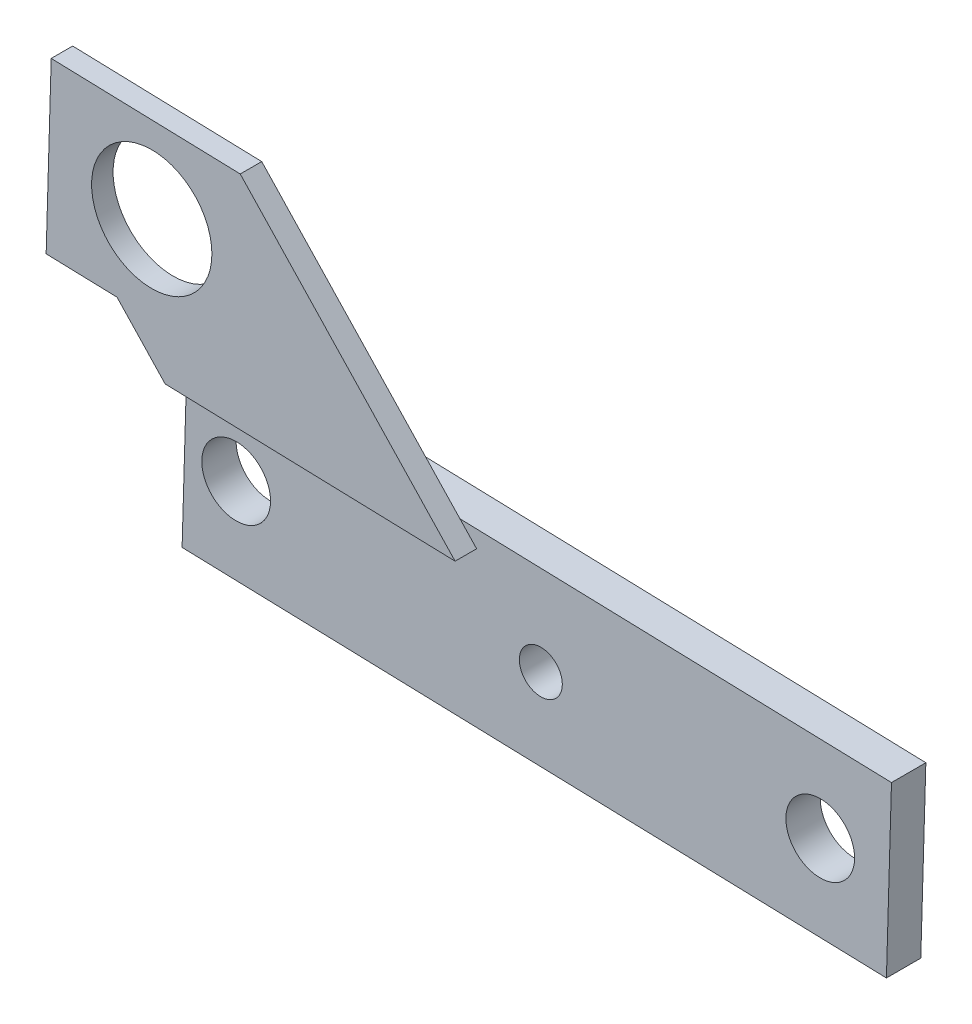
ISO-10303-21;
HEADER;
FILE_DESCRIPTION(('STEP AP214'),'2;1');
FILE_NAME('part.step','',(''),(''),'','','');
FILE_SCHEMA(('AUTOMOTIVE_DESIGN { 1 0 10303 214 1 1 1 1 }'));
ENDSEC;
DATA;
#1=APPLICATION_CONTEXT('core data for automotive mechanical design processes');
#2=APPLICATION_PROTOCOL_DEFINITION('international standard','automotive_design',2000,#1);
#3=PRODUCT_CONTEXT('',#1,'mechanical');
#4=PRODUCT('Part','Part','',(#3));
#5=PRODUCT_RELATED_PRODUCT_CATEGORY('part','',(#4));
#6=PRODUCT_DEFINITION_FORMATION('','',#4);
#7=PRODUCT_DEFINITION_CONTEXT('part definition',#1,'design');
#8=PRODUCT_DEFINITION('design','',#6,#7);
#9=PRODUCT_DEFINITION_SHAPE('','',#8);
#10=(LENGTH_UNIT() NAMED_UNIT(*) SI_UNIT(.MILLI.,.METRE.));
#11=(NAMED_UNIT(*) PLANE_ANGLE_UNIT() SI_UNIT($,.RADIAN.));
#12=(NAMED_UNIT(*) SI_UNIT($,.STERADIAN.) SOLID_ANGLE_UNIT());
#13=UNCERTAINTY_MEASURE_WITH_UNIT(LENGTH_MEASURE(1.E-05),#10,'distance_accuracy_value','');
#14=(GEOMETRIC_REPRESENTATION_CONTEXT(3) GLOBAL_UNCERTAINTY_ASSIGNED_CONTEXT((#13)) GLOBAL_UNIT_ASSIGNED_CONTEXT((#10,
#11,#12)) REPRESENTATION_CONTEXT('',''));
#15=CARTESIAN_POINT('',(0.,0.,0.));
#16=DIRECTION('',(0.,0.,1.));
#17=DIRECTION('',(1.,0.,0.));
#18=AXIS2_PLACEMENT_3D('',#15,#16,#17);
#19=CARTESIAN_POINT('',(41.4981401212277,-18.1154839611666,2.));
#20=DIRECTION('',(0.,0.,-1.));
#21=DIRECTION('',(-1.,0.,0.));
#22=AXIS2_PLACEMENT_3D('',#19,#20,#21);
#23=PLANE('',#22);
#24=CARTESIAN_POINT('',(3.66163848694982,-12.,2.));
#25=DIRECTION('',(0.,0.,1.));
#26=DIRECTION('',(1.,0.,0.));
#27=AXIS2_PLACEMENT_3D('',#24,#25,#26);
#28=CIRCLE('',#27,2.);
#29=CARTESIAN_POINT('',(5.66163848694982,-12.,2.));
#30=VERTEX_POINT('',#29);
#31=EDGE_CURVE('E188',#30,#30,#28,.T.);
#32=ORIENTED_EDGE('',*,*,#31,.F.);
#33=EDGE_LOOP('',(#32));
#34=FACE_BOUND('',#33,.T.);
#35=CARTESIAN_POINT('',(37.6469294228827,-13.,2.));
#36=DIRECTION('',(0.,0.,1.));
#37=DIRECTION('',(1.,0.,0.));
#38=AXIS2_PLACEMENT_3D('',#35,#36,#37);
#39=CIRCLE('',#38,2.);
#40=CARTESIAN_POINT('',(39.6469294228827,-13.,2.));
#41=VERTEX_POINT('',#40);
#42=EDGE_CURVE('E197',#41,#41,#39,.T.);
#43=ORIENTED_EDGE('',*,*,#42,.F.);
#44=EDGE_LOOP('',(#43));
#45=FACE_BOUND('',#44,.T.);
#46=CARTESIAN_POINT('',(21.3892111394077,-12.75,2.));
#47=DIRECTION('',(0.,0.,1.));
#48=DIRECTION('',(1.,0.,0.));
#49=AXIS2_PLACEMENT_3D('',#46,#47,#48);
#50=CIRCLE('',#49,1.25);
#51=CARTESIAN_POINT('',(22.6392111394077,-12.75,2.));
#52=VERTEX_POINT('',#51);
#53=EDGE_CURVE('E191',#52,#52,#50,.T.);
#54=ORIENTED_EDGE('',*,*,#53,.F.);
#55=EDGE_LOOP('',(#54));
#56=FACE_BOUND('',#55,.T.);
#57=DIRECTION('',(-0.686003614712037,0.727598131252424,0.));
#58=VECTOR('',#57,1.);
#59=CARTESIAN_POINT('',(5.14965454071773,4.85063805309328,2.));
#60=LINE('',#59,#58);
#61=CARTESIAN_POINT('',(17.6521598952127,-8.40993279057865,2.));
#62=VERTEX_POINT('',#61);
#63=CARTESIAN_POINT('',(16.68200427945,-7.38095364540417,2.));
#64=VERTEX_POINT('',#63);
#65=EDGE_CURVE('E150',#62,#64,#60,.T.);
#66=ORIENTED_EDGE('',*,*,#65,.F.);
#67=DIRECTION('',(0.999567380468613,-0.0294117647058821,0.));
#68=VECTOR('',#67,1.);
#69=CARTESIAN_POINT('',(0.780583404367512,-7.9134951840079,2.));
#70=LINE('',#69,#68);
#71=CARTESIAN_POINT('',(0.780583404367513,-7.9134951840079,2.));
#72=VERTEX_POINT('',#71);
#73=EDGE_CURVE('E47',#72,#62,#70,.T.);
#74=ORIENTED_EDGE('',*,*,#73,.F.);
#75=DIRECTION('',(-0.0294117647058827,-0.999567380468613,0.));
#76=VECTOR('',#75,1.);
#77=CARTESIAN_POINT('',(0.809995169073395,-6.91392780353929,2.));
#78=LINE('',#77,#76);
#79=CARTESIAN_POINT('',(0.515877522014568,-16.9096016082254,2.));
#80=VERTEX_POINT('',#79);
#81=EDGE_CURVE('E214',#72,#80,#78,.T.);
#82=ORIENTED_EDGE('',*,*,#81,.T.);
#83=DIRECTION('',(0.999567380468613,-0.0294117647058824,0.));
#84=VECTOR('',#83,1.);
#85=CARTESIAN_POINT('',(41.4981401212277,-18.1154839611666,2.));
#86=LINE('',#85,#84);
#87=CARTESIAN_POINT('',(41.4981401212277,-18.1154839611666,2.));
#88=VERTEX_POINT('',#87);
#89=EDGE_CURVE('E217',#80,#88,#86,.T.);
#90=ORIENTED_EDGE('',*,*,#89,.T.);
#91=DIRECTION('',(0.0294117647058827,0.999567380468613,0.));
#92=VECTOR('',#91,1.);
#93=CARTESIAN_POINT('',(41.7922577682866,-8.11981015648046,2.));
#94=LINE('',#93,#92);
#95=CARTESIAN_POINT('',(41.7922577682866,-8.11981015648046,2.));
#96=VERTEX_POINT('',#95);
#97=EDGE_CURVE('E209',#88,#96,#94,.T.);
#98=ORIENTED_EDGE('',*,*,#97,.T.);
#99=DIRECTION('',(-0.999567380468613,0.0294117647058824,0.));
#100=VECTOR('',#99,1.);
#101=CARTESIAN_POINT('',(41.7922577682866,-8.11981015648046,2.));
#102=LINE('',#101,#100);
#103=EDGE_CURVE('E212',#96,#64,#102,.T.);
#104=ORIENTED_EDGE('',*,*,#103,.T.);
#105=EDGE_LOOP('',(#66,#74,#82,#90,#98,#104));
#106=FACE_BOUND('',#105,.T.);
#107=ADVANCED_FACE('F32',(#34,#45,#56,#106),#23,.F.);
#108=CARTESIAN_POINT('',(41.4981401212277,-18.1154839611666,0.));
#109=DIRECTION('',(0.,0.,-1.));
#110=DIRECTION('',(-1.,0.,0.));
#111=AXIS2_PLACEMENT_3D('',#108,#109,#110);
#112=PLANE('',#111);
#113=CARTESIAN_POINT('',(3.66163848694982,-12.,0.));
#114=DIRECTION('',(0.,0.,1.));
#115=DIRECTION('',(1.,0.,0.));
#116=AXIS2_PLACEMENT_3D('',#113,#114,#115);
#117=CIRCLE('',#116,2.);
#118=CARTESIAN_POINT('',(5.66163848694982,-12.,0.));
#119=VERTEX_POINT('',#118);
#120=EDGE_CURVE('E183',#119,#119,#117,.T.);
#121=ORIENTED_EDGE('',*,*,#120,.T.);
#122=EDGE_LOOP('',(#121));
#123=FACE_BOUND('',#122,.T.);
#124=CARTESIAN_POINT('',(37.6469294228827,-13.,0.));
#125=DIRECTION('',(0.,0.,1.));
#126=DIRECTION('',(1.,0.,0.));
#127=AXIS2_PLACEMENT_3D('',#124,#125,#126);
#128=CIRCLE('',#127,2.);
#129=CARTESIAN_POINT('',(39.6469294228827,-13.,0.));
#130=VERTEX_POINT('',#129);
#131=EDGE_CURVE('E194',#130,#130,#128,.T.);
#132=ORIENTED_EDGE('',*,*,#131,.T.);
#133=EDGE_LOOP('',(#132));
#134=FACE_BOUND('',#133,.T.);
#135=DIRECTION('',(0.0294117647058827,0.999567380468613,0.));
#136=VECTOR('',#135,1.);
#137=CARTESIAN_POINT('',(41.7922577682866,-8.11981015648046,0.));
#138=LINE('',#137,#136);
#139=CARTESIAN_POINT('',(41.4981401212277,-18.1154839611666,0.));
#140=VERTEX_POINT('',#139);
#141=CARTESIAN_POINT('',(41.7922577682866,-8.11981015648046,0.));
#142=VERTEX_POINT('',#141);
#143=EDGE_CURVE('E200',#140,#142,#138,.T.);
#144=ORIENTED_EDGE('',*,*,#143,.F.);
#145=DIRECTION('',(0.999567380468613,-0.0294117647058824,0.));
#146=VECTOR('',#145,1.);
#147=CARTESIAN_POINT('',(41.4981401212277,-18.1154839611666,0.));
#148=LINE('',#147,#146);
#149=CARTESIAN_POINT('',(0.515877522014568,-16.9096016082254,0.));
#150=VERTEX_POINT('',#149);
#151=EDGE_CURVE('E207',#150,#140,#148,.T.);
#152=ORIENTED_EDGE('',*,*,#151,.F.);
#153=DIRECTION('',(-0.0294117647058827,-0.999567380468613,0.));
#154=VECTOR('',#153,1.);
#155=CARTESIAN_POINT('',(0.809995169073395,-6.91392780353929,0.));
#156=LINE('',#155,#154);
#157=CARTESIAN_POINT('',(0.809995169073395,-6.91392780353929,0.));
#158=VERTEX_POINT('',#157);
#159=EDGE_CURVE('E205',#158,#150,#156,.T.);
#160=ORIENTED_EDGE('',*,*,#159,.F.);
#161=DIRECTION('',(-0.999567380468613,0.0294117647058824,0.));
#162=VECTOR('',#161,1.);
#163=CARTESIAN_POINT('',(41.7922577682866,-8.11981015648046,0.));
#164=LINE('',#163,#162);
#165=EDGE_CURVE('E203',#142,#158,#164,.T.);
#166=ORIENTED_EDGE('',*,*,#165,.F.);
#167=EDGE_LOOP('',(#144,#152,#160,#166));
#168=FACE_BOUND('',#167,.T.);
#169=CARTESIAN_POINT('',(21.3892111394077,-12.75,0.));
#170=DIRECTION('',(0.,0.,-1.));
#171=DIRECTION('',(-1.,0.,0.));
#172=AXIS2_PLACEMENT_3D('',#169,#170,#171);
#173=CIRCLE('',#172,2.5);
#174=CARTESIAN_POINT('',(18.8892111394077,-12.75,0.));
#175=VERTEX_POINT('',#174);
#176=EDGE_CURVE('E133',#175,#175,#173,.T.);
#177=ORIENTED_EDGE('',*,*,#176,.F.);
#178=EDGE_LOOP('',(#177));
#179=FACE_BOUND('',#178,.T.);
#180=ADVANCED_FACE('F233',(#123,#134,#168,#179),#112,.T.);
#181=CARTESIAN_POINT('',(41.7922577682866,-8.11981015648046,2.));
#182=DIRECTION('',(-0.999567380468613,0.0294117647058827,0.));
#183=DIRECTION('',(-0.0294117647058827,-0.999567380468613,0.));
#184=AXIS2_PLACEMENT_3D('',#181,#182,#183);
#185=PLANE('',#184);
#186=ORIENTED_EDGE('',*,*,#143,.T.);
#187=DIRECTION('',(0.,0.,-1.));
#188=VECTOR('',#187,1.);
#189=CARTESIAN_POINT('',(41.7922577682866,-8.11981015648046,2.));
#190=LINE('',#189,#188);
#191=EDGE_CURVE('E11',#96,#142,#190,.T.);
#192=ORIENTED_EDGE('',*,*,#191,.F.);
#193=ORIENTED_EDGE('',*,*,#97,.F.);
#194=DIRECTION('',(0.,0.,-1.));
#195=VECTOR('',#194,1.);
#196=CARTESIAN_POINT('',(41.4981401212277,-18.1154839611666,2.));
#197=LINE('',#196,#195);
#198=EDGE_CURVE('E219',#88,#140,#197,.T.);
#199=ORIENTED_EDGE('',*,*,#198,.T.);
#200=EDGE_LOOP('',(#186,#192,#193,#199));
#201=FACE_BOUND('',#200,.T.);
#202=ADVANCED_FACE('F34',(#201),#185,.F.);
#203=CARTESIAN_POINT('',(41.7922577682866,-8.11981015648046,2.));
#204=DIRECTION('',(-0.0294117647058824,-0.999567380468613,0.));
#205=DIRECTION('',(0.999567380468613,-0.0294117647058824,0.));
#206=AXIS2_PLACEMENT_3D('',#203,#204,#205);
#207=PLANE('',#206);
#208=ORIENTED_EDGE('',*,*,#165,.T.);
#209=DIRECTION('',(0.,0.,-1.));
#210=VECTOR('',#209,1.);
#211=CARTESIAN_POINT('',(0.809995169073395,-6.91392780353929,2.));
#212=LINE('',#211,#210);
#213=CARTESIAN_POINT('',(0.809995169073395,-6.91392780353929,2.));
#214=VERTEX_POINT('',#213);
#215=EDGE_CURVE('E40',#214,#158,#212,.T.);
#216=ORIENTED_EDGE('',*,*,#215,.F.);
#217=EDGE_CURVE('E55',#64,#214,#102,.T.);
#218=ORIENTED_EDGE('',*,*,#217,.F.);
#219=ORIENTED_EDGE('',*,*,#103,.F.);
#220=ORIENTED_EDGE('',*,*,#191,.T.);
#221=EDGE_LOOP('',(#208,#216,#218,#219,#220));
#222=FACE_BOUND('',#221,.T.);
#223=ADVANCED_FACE('F285',(#222),#207,.F.);
#224=CARTESIAN_POINT('',(0.809995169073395,-6.91392780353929,2.));
#225=DIRECTION('',(0.999567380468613,-0.0294117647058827,0.));
#226=DIRECTION('',(0.0294117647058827,0.999567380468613,0.));
#227=AXIS2_PLACEMENT_3D('',#224,#225,#226);
#228=PLANE('',#227);
#229=ORIENTED_EDGE('',*,*,#159,.T.);
#230=DIRECTION('',(0.,0.,-1.));
#231=VECTOR('',#230,1.);
#232=CARTESIAN_POINT('',(0.515877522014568,-16.9096016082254,2.));
#233=LINE('',#232,#231);
#234=EDGE_CURVE('E222',#80,#150,#233,.T.);
#235=ORIENTED_EDGE('',*,*,#234,.F.);
#236=ORIENTED_EDGE('',*,*,#81,.F.);
#237=EDGE_CURVE('E215',#214,#72,#78,.T.);
#238=ORIENTED_EDGE('',*,*,#237,.F.);
#239=ORIENTED_EDGE('',*,*,#215,.T.);
#240=EDGE_LOOP('',(#229,#235,#236,#238,#239));
#241=FACE_BOUND('',#240,.T.);
#242=ADVANCED_FACE('F228',(#241),#228,.F.);
#243=CARTESIAN_POINT('',(41.4981401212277,-18.1154839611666,2.));
#244=DIRECTION('',(0.0294117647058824,0.999567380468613,0.));
#245=DIRECTION('',(-0.999567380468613,0.0294117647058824,0.));
#246=AXIS2_PLACEMENT_3D('',#243,#244,#245);
#247=PLANE('',#246);
#248=ORIENTED_EDGE('',*,*,#151,.T.);
#249=ORIENTED_EDGE('',*,*,#198,.F.);
#250=ORIENTED_EDGE('',*,*,#89,.F.);
#251=ORIENTED_EDGE('',*,*,#234,.T.);
#252=EDGE_LOOP('',(#248,#249,#250,#251));
#253=FACE_BOUND('',#252,.T.);
#254=ADVANCED_FACE('F237',(#253),#247,.F.);
#255=CARTESIAN_POINT('',(37.6469294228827,-13.,2.));
#256=DIRECTION('',(0.,0.,-1.));
#257=DIRECTION('',(-1.,0.,0.));
#258=AXIS2_PLACEMENT_3D('',#255,#256,#257);
#259=CYLINDRICAL_SURFACE('',#258,2.);
#260=ORIENTED_EDGE('',*,*,#42,.T.);
#261=EDGE_LOOP('',(#260));
#262=FACE_BOUND('',#261,.T.);
#263=ORIENTED_EDGE('',*,*,#131,.F.);
#264=EDGE_LOOP('',(#263));
#265=FACE_BOUND('',#264,.T.);
#266=ADVANCED_FACE('F283',(#262,#265),#259,.F.);
#267=CARTESIAN_POINT('',(21.3892111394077,-12.75,2.));
#268=DIRECTION('',(0.,0.,-1.));
#269=DIRECTION('',(-1.,0.,0.));
#270=AXIS2_PLACEMENT_3D('',#267,#268,#269);
#271=CYLINDRICAL_SURFACE('',#270,1.25);
#272=ORIENTED_EDGE('',*,*,#53,.T.);
#273=EDGE_LOOP('',(#272));
#274=FACE_BOUND('',#273,.T.);
#275=CARTESIAN_POINT('',(21.3892111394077,-12.75,-2.45));
#276=DIRECTION('',(0.,0.,-1.));
#277=DIRECTION('',(-0.999945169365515,0.0104717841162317,0.));
#278=AXIS2_PLACEMENT_3D('',#275,#276,#277);
#279=CIRCLE('',#278,1.25);
#280=CARTESIAN_POINT('',(20.1392796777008,-12.7369102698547,-2.45));
#281=VERTEX_POINT('',#280);
#282=EDGE_CURVE('E177',#281,#281,#279,.T.);
#283=ORIENTED_EDGE('',*,*,#282,.T.);
#284=EDGE_LOOP('',(#283));
#285=FACE_BOUND('',#284,.T.);
#286=ADVANCED_FACE('F399',(#274,#285),#271,.F.);
#287=CARTESIAN_POINT('',(3.66163848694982,-12.,2.));
#288=DIRECTION('',(0.,0.,-1.));
#289=DIRECTION('',(-1.,0.,0.));
#290=AXIS2_PLACEMENT_3D('',#287,#288,#289);
#291=CYLINDRICAL_SURFACE('',#290,2.);
#292=ORIENTED_EDGE('',*,*,#31,.T.);
#293=EDGE_LOOP('',(#292));
#294=FACE_BOUND('',#293,.T.);
#295=ORIENTED_EDGE('',*,*,#120,.F.);
#296=EDGE_LOOP('',(#295));
#297=FACE_BOUND('',#296,.T.);
#298=ADVANCED_FACE('F392',(#294,#297),#291,.F.);
#299=CARTESIAN_POINT('',(21.3892111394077,-12.75,-9.52106781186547));
#300=DIRECTION('',(0.,0.,1.));
#301=DIRECTION('',(1.,0.,0.));
#302=AXIS2_PLACEMENT_3D('',#299,#300,#301);
#303=CYLINDRICAL_SURFACE('',#302,2.5);
#304=ORIENTED_EDGE('',*,*,#176,.T.);
#305=EDGE_LOOP('',(#304));
#306=FACE_BOUND('',#305,.T.);
#307=CARTESIAN_POINT('',(21.3892111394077,-12.75,-2.45));
#308=DIRECTION('',(0.,0.,-1.));
#309=DIRECTION('',(-1.,0.,0.));
#310=AXIS2_PLACEMENT_3D('',#307,#308,#309);
#311=CIRCLE('',#310,2.5);
#312=CARTESIAN_POINT('',(18.8892111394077,-12.75,-2.45));
#313=VERTEX_POINT('',#312);
#314=EDGE_CURVE('E180',#313,#313,#311,.T.);
#315=ORIENTED_EDGE('',*,*,#314,.F.);
#316=EDGE_LOOP('',(#315));
#317=FACE_BOUND('',#316,.T.);
#318=ADVANCED_FACE('F385',(#306,#317),#303,.T.);
#319=CARTESIAN_POINT('',(21.3892111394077,-12.75,-2.45));
#320=DIRECTION('',(0.,0.,-1.));
#321=DIRECTION('',(-0.999945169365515,0.0104717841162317,0.));
#322=AXIS2_PLACEMENT_3D('',#319,#320,#321);
#323=PLANE('',#322);
#324=ORIENTED_EDGE('',*,*,#282,.F.);
#325=EDGE_LOOP('',(#324));
#326=FACE_BOUND('',#325,.T.);
#327=ORIENTED_EDGE('',*,*,#314,.T.);
#328=EDGE_LOOP('',(#327));
#329=FACE_BOUND('',#328,.T.);
#330=ADVANCED_FACE('F308',(#326,#329),#323,.T.);
#331=CARTESIAN_POINT('',(-6.22937820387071,-7.70723060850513,2.));
#332=DIRECTION('',(0.,0.,1.));
#333=DIRECTION('',(1.,0.,0.));
#334=AXIS2_PLACEMENT_3D('',#331,#332,#333);
#335=PLANE('',#334);
#336=CARTESIAN_POINT('',(0.,0.,2.));
#337=DIRECTION('',(0.,0.,1.));
#338=DIRECTION('',(1.,0.,0.));
#339=AXIS2_PLACEMENT_3D('',#336,#337,#338);
#340=CIRCLE('',#339,3.5);
#341=CARTESIAN_POINT('',(3.5,0.,2.));
#342=VERTEX_POINT('',#341);
#343=EDGE_CURVE('E143',#342,#342,#340,.T.);
#344=ORIENTED_EDGE('',*,*,#343,.T.);
#345=EDGE_LOOP('',(#344));
#346=FACE_BOUND('',#345,.T.);
#347=CARTESIAN_POINT('',(5.14965454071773,4.85063805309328,2.));
#348=VERTEX_POINT('',#347);
#349=EDGE_CURVE('E149',#64,#348,#60,.T.);
#350=ORIENTED_EDGE('',*,*,#349,.F.);
#351=ORIENTED_EDGE('',*,*,#217,.T.);
#352=ORIENTED_EDGE('',*,*,#237,.T.);
#353=DIRECTION('',(0.686003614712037,-0.727598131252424,0.));
#354=VECTOR('',#353,1.);
#355=CARTESIAN_POINT('',(-2.0203657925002,-4.94271579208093,2.));
#356=LINE('',#355,#354);
#357=CARTESIAN_POINT('',(-2.0203657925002,-4.94271579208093,2.));
#358=VERTEX_POINT('',#357);
#359=EDGE_CURVE('E121',#358,#72,#356,.T.);
#360=ORIENTED_EDGE('',*,*,#359,.F.);
#361=DIRECTION('',(0.999567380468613,-0.0294117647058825,0.));
#362=VECTOR('',#361,1.);
#363=CARTESIAN_POINT('',(-6.14446310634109,-4.82136631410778,2.));
#364=LINE('',#363,#362);
#365=CARTESIAN_POINT('',(-6.14446310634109,-4.82136631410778,2.));
#366=VERTEX_POINT('',#365);
#367=EDGE_CURVE('E112',#366,#358,#364,.T.);
#368=ORIENTED_EDGE('',*,*,#367,.F.);
#369=DIRECTION('',(-0.0294117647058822,-0.999567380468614,0.));
#370=VECTOR('',#369,1.);
#371=CARTESIAN_POINT('',(-5.85034545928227,5.17430749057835,2.));
#372=LINE('',#371,#370);
#373=CARTESIAN_POINT('',(-5.85034545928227,5.17430749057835,2.));
#374=VERTEX_POINT('',#373);
#375=EDGE_CURVE('E118',#374,#366,#372,.T.);
#376=ORIENTED_EDGE('',*,*,#375,.F.);
#377=DIRECTION('',(-0.999567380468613,0.0294117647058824,0.));
#378=VECTOR('',#377,1.);
#379=CARTESIAN_POINT('',(-5.85034545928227,5.17430749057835,2.));
#380=LINE('',#379,#378);
#381=EDGE_CURVE('E153',#348,#374,#380,.T.);
#382=ORIENTED_EDGE('',*,*,#381,.F.);
#383=EDGE_LOOP('',(#350,#351,#352,#360,#368,#376,#382));
#384=FACE_BOUND('',#383,.T.);
#385=ADVANCED_FACE('F115',(#346,#384),#335,.F.);
#386=CARTESIAN_POINT('',(-6.22937820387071,-7.70723060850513,3.25));
#387=DIRECTION('',(0.,0.,1.));
#388=DIRECTION('',(1.,0.,0.));
#389=AXIS2_PLACEMENT_3D('',#386,#387,#388);
#390=PLANE('',#389);
#391=DIRECTION('',(-0.0294117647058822,-0.999567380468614,0.));
#392=VECTOR('',#391,1.);
#393=CARTESIAN_POINT('',(-5.85034545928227,5.17430749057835,3.25));
#394=LINE('',#393,#392);
#395=CARTESIAN_POINT('',(-5.85034545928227,5.17430749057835,3.25));
#396=VERTEX_POINT('',#395);
#397=CARTESIAN_POINT('',(-6.14446310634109,-4.82136631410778,3.25));
#398=VERTEX_POINT('',#397);
#399=EDGE_CURVE('E155',#396,#398,#394,.T.);
#400=ORIENTED_EDGE('',*,*,#399,.T.);
#401=DIRECTION('',(0.999567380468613,-0.0294117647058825,0.));
#402=VECTOR('',#401,1.);
#403=CARTESIAN_POINT('',(-6.14446310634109,-4.82136631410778,3.25));
#404=LINE('',#403,#402);
#405=CARTESIAN_POINT('',(-2.0203657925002,-4.94271579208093,3.25));
#406=VERTEX_POINT('',#405);
#407=EDGE_CURVE('E129',#398,#406,#404,.T.);
#408=ORIENTED_EDGE('',*,*,#407,.T.);
#409=DIRECTION('',(0.686003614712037,-0.727598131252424,0.));
#410=VECTOR('',#409,1.);
#411=CARTESIAN_POINT('',(-2.0203657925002,-4.94271579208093,3.25));
#412=LINE('',#411,#410);
#413=CARTESIAN_POINT('',(0.780583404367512,-7.9134951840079,3.25));
#414=VERTEX_POINT('',#413);
#415=EDGE_CURVE('E158',#406,#414,#412,.T.);
#416=ORIENTED_EDGE('',*,*,#415,.T.);
#417=DIRECTION('',(0.999567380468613,-0.0294117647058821,0.));
#418=VECTOR('',#417,1.);
#419=CARTESIAN_POINT('',(0.780583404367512,-7.9134951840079,3.25));
#420=LINE('',#419,#418);
#421=CARTESIAN_POINT('',(17.6521598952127,-8.40993279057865,3.25));
#422=VERTEX_POINT('',#421);
#423=EDGE_CURVE('E160',#414,#422,#420,.T.);
#424=ORIENTED_EDGE('',*,*,#423,.T.);
#425=DIRECTION('',(-0.686003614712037,0.727598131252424,0.));
#426=VECTOR('',#425,1.);
#427=CARTESIAN_POINT('',(5.14965454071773,4.85063805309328,3.25));
#428=LINE('',#427,#426);
#429=CARTESIAN_POINT('',(5.14965454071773,4.85063805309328,3.25));
#430=VERTEX_POINT('',#429);
#431=EDGE_CURVE('E162',#422,#430,#428,.T.);
#432=ORIENTED_EDGE('',*,*,#431,.T.);
#433=DIRECTION('',(-0.999567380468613,0.0294117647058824,0.));
#434=VECTOR('',#433,1.);
#435=CARTESIAN_POINT('',(-5.85034545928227,5.17430749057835,3.25));
#436=LINE('',#435,#434);
#437=EDGE_CURVE('E164',#430,#396,#436,.T.);
#438=ORIENTED_EDGE('',*,*,#437,.T.);
#439=EDGE_LOOP('',(#400,#408,#416,#424,#432,#438));
#440=FACE_BOUND('',#439,.T.);
#441=CARTESIAN_POINT('',(0.,0.,3.25));
#442=DIRECTION('',(0.,0.,1.));
#443=DIRECTION('',(1.,0.,0.));
#444=AXIS2_PLACEMENT_3D('',#441,#442,#443);
#445=CIRCLE('',#444,3.5);
#446=CARTESIAN_POINT('',(3.5,0.,3.25));
#447=VERTEX_POINT('',#446);
#448=EDGE_CURVE('E140',#447,#447,#445,.T.);
#449=ORIENTED_EDGE('',*,*,#448,.F.);
#450=EDGE_LOOP('',(#449));
#451=FACE_BOUND('',#450,.T.);
#452=ADVANCED_FACE('F252',(#440,#451),#390,.T.);
#453=CARTESIAN_POINT('',(-5.85034545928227,5.17430749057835,3.25));
#454=DIRECTION('',(0.999567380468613,-0.0294117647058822,0.));
#455=DIRECTION('',(0.0294117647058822,0.999567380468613,0.));
#456=AXIS2_PLACEMENT_3D('',#453,#454,#455);
#457=PLANE('',#456);
#458=ORIENTED_EDGE('',*,*,#375,.T.);
#459=DIRECTION('',(0.,0.,-1.));
#460=VECTOR('',#459,1.);
#461=CARTESIAN_POINT('',(-6.14446310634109,-4.82136631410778,3.25));
#462=LINE('',#461,#460);
#463=EDGE_CURVE('E127',#398,#366,#462,.T.);
#464=ORIENTED_EDGE('',*,*,#463,.F.);
#465=ORIENTED_EDGE('',*,*,#399,.F.);
#466=DIRECTION('',(0.,0.,-1.));
#467=VECTOR('',#466,1.);
#468=CARTESIAN_POINT('',(-5.85034545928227,5.17430749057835,3.25));
#469=LINE('',#468,#467);
#470=EDGE_CURVE('E139',#396,#374,#469,.T.);
#471=ORIENTED_EDGE('',*,*,#470,.T.);
#472=EDGE_LOOP('',(#458,#464,#465,#471));
#473=FACE_BOUND('',#472,.T.);
#474=ADVANCED_FACE('F137',(#473),#457,.F.);
#475=CARTESIAN_POINT('',(-6.14446310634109,-4.82136631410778,3.25));
#476=DIRECTION('',(0.0294117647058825,0.999567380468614,0.));
#477=DIRECTION('',(-0.999567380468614,0.0294117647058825,0.));
#478=AXIS2_PLACEMENT_3D('',#475,#476,#477);
#479=PLANE('',#478);
#480=ORIENTED_EDGE('',*,*,#367,.T.);
#481=DIRECTION('',(0.,0.,-1.));
#482=VECTOR('',#481,1.);
#483=CARTESIAN_POINT('',(-2.0203657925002,-4.94271579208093,3.25));
#484=LINE('',#483,#482);
#485=EDGE_CURVE('E134',#406,#358,#484,.T.);
#486=ORIENTED_EDGE('',*,*,#485,.F.);
#487=ORIENTED_EDGE('',*,*,#407,.F.);
#488=ORIENTED_EDGE('',*,*,#463,.T.);
#489=EDGE_LOOP('',(#480,#486,#487,#488));
#490=FACE_BOUND('',#489,.T.);
#491=ADVANCED_FACE('F128',(#490),#479,.F.);
#492=CARTESIAN_POINT('',(-2.0203657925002,-4.94271579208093,3.25));
#493=DIRECTION('',(0.727598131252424,0.686003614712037,0.));
#494=DIRECTION('',(-0.686003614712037,0.727598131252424,0.));
#495=AXIS2_PLACEMENT_3D('',#492,#493,#494);
#496=PLANE('',#495);
#497=ORIENTED_EDGE('',*,*,#359,.T.);
#498=DIRECTION('',(0.,0.,-1.));
#499=VECTOR('',#498,1.);
#500=CARTESIAN_POINT('',(0.780583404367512,-7.9134951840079,3.25));
#501=LINE('',#500,#499);
#502=EDGE_CURVE('E173',#414,#72,#501,.T.);
#503=ORIENTED_EDGE('',*,*,#502,.F.);
#504=ORIENTED_EDGE('',*,*,#415,.F.);
#505=ORIENTED_EDGE('',*,*,#485,.T.);
#506=EDGE_LOOP('',(#497,#503,#504,#505));
#507=FACE_BOUND('',#506,.T.);
#508=ADVANCED_FACE('F244',(#507),#496,.F.);
#509=CARTESIAN_POINT('',(0.780583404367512,-7.9134951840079,3.25));
#510=DIRECTION('',(0.0294117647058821,0.999567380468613,0.));
#511=DIRECTION('',(-0.999567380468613,0.0294117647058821,0.));
#512=AXIS2_PLACEMENT_3D('',#509,#510,#511);
#513=PLANE('',#512);
#514=ORIENTED_EDGE('',*,*,#73,.T.);
#515=DIRECTION('',(0.,0.,-1.));
#516=VECTOR('',#515,1.);
#517=CARTESIAN_POINT('',(17.6521598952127,-8.40993279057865,3.25));
#518=LINE('',#517,#516);
#519=EDGE_CURVE('E170',#422,#62,#518,.T.);
#520=ORIENTED_EDGE('',*,*,#519,.F.);
#521=ORIENTED_EDGE('',*,*,#423,.F.);
#522=ORIENTED_EDGE('',*,*,#502,.T.);
#523=EDGE_LOOP('',(#514,#520,#521,#522));
#524=FACE_BOUND('',#523,.T.);
#525=ADVANCED_FACE('F248',(#524),#513,.F.);
#526=CARTESIAN_POINT('',(5.14965454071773,4.85063805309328,3.25));
#527=DIRECTION('',(-0.727598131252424,-0.686003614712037,0.));
#528=DIRECTION('',(0.686003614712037,-0.727598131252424,0.));
#529=AXIS2_PLACEMENT_3D('',#526,#527,#528);
#530=PLANE('',#529);
#531=ORIENTED_EDGE('',*,*,#65,.T.);
#532=ORIENTED_EDGE('',*,*,#349,.T.);
#533=DIRECTION('',(0.,0.,-1.));
#534=VECTOR('',#533,1.);
#535=CARTESIAN_POINT('',(5.14965454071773,4.85063805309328,3.25));
#536=LINE('',#535,#534);
#537=EDGE_CURVE('E167',#430,#348,#536,.T.);
#538=ORIENTED_EDGE('',*,*,#537,.F.);
#539=ORIENTED_EDGE('',*,*,#431,.F.);
#540=ORIENTED_EDGE('',*,*,#519,.T.);
#541=EDGE_LOOP('',(#531,#532,#538,#539,#540));
#542=FACE_BOUND('',#541,.T.);
#543=ADVANCED_FACE('F259',(#542),#530,.F.);
#544=CARTESIAN_POINT('',(-5.85034545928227,5.17430749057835,3.25));
#545=DIRECTION('',(-0.0294117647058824,-0.999567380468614,0.));
#546=DIRECTION('',(0.999567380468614,-0.0294117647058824,0.));
#547=AXIS2_PLACEMENT_3D('',#544,#545,#546);
#548=PLANE('',#547);
#549=ORIENTED_EDGE('',*,*,#381,.T.);
#550=ORIENTED_EDGE('',*,*,#470,.F.);
#551=ORIENTED_EDGE('',*,*,#437,.F.);
#552=ORIENTED_EDGE('',*,*,#537,.T.);
#553=EDGE_LOOP('',(#549,#550,#551,#552));
#554=FACE_BOUND('',#553,.T.);
#555=ADVANCED_FACE('F257',(#554),#548,.F.);
#556=CARTESIAN_POINT('',(0.,0.,3.25));
#557=DIRECTION('',(0.,0.,-1.));
#558=DIRECTION('',(-1.,0.,0.));
#559=AXIS2_PLACEMENT_3D('',#556,#557,#558);
#560=CYLINDRICAL_SURFACE('',#559,3.5);
#561=ORIENTED_EDGE('',*,*,#448,.T.);
#562=EDGE_LOOP('',(#561));
#563=FACE_BOUND('',#562,.T.);
#564=ORIENTED_EDGE('',*,*,#343,.F.);
#565=EDGE_LOOP('',(#564));
#566=FACE_BOUND('',#565,.T.);
#567=ADVANCED_FACE('F266',(#563,#566),#560,.F.);
#568=CLOSED_SHELL('',(#107,#180,#202,#223,#242,#254,#266,#286,#298,#318,#330,#385,#452,#474,
#491,#508,#525,#543,#555,#567));
#569=MANIFOLD_SOLID_BREP('B2',#568);
#570=ADVANCED_BREP_SHAPE_REPRESENTATION('',(#18,#569),#14);
#571=SHAPE_DEFINITION_REPRESENTATION(#9,#570);
ENDSEC;
END-ISO-10303-21;
